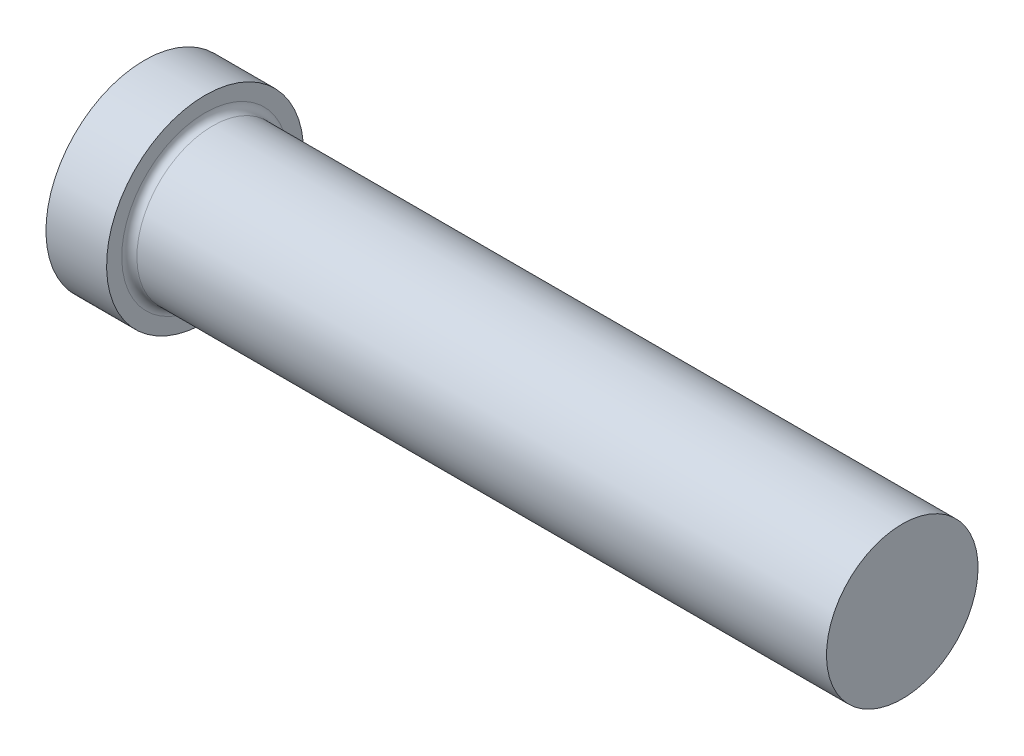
ISO-10303-21;
HEADER;
FILE_DESCRIPTION(('STEP AP214'),'2;1');
FILE_NAME('part.step','',(''),(''),'','','');
FILE_SCHEMA(('AUTOMOTIVE_DESIGN { 1 0 10303 214 1 1 1 1 }'));
ENDSEC;
DATA;
#1=APPLICATION_CONTEXT('core data for automotive mechanical design processes');
#2=APPLICATION_PROTOCOL_DEFINITION('international standard','automotive_design',2000,#1);
#3=PRODUCT_CONTEXT('',#1,'mechanical');
#4=PRODUCT('Part','Part','',(#3));
#5=PRODUCT_RELATED_PRODUCT_CATEGORY('part','',(#4));
#6=PRODUCT_DEFINITION_FORMATION('','',#4);
#7=PRODUCT_DEFINITION_CONTEXT('part definition',#1,'design');
#8=PRODUCT_DEFINITION('design','',#6,#7);
#9=PRODUCT_DEFINITION_SHAPE('','',#8);
#10=(LENGTH_UNIT() NAMED_UNIT(*) SI_UNIT(.MILLI.,.METRE.));
#11=(NAMED_UNIT(*) PLANE_ANGLE_UNIT() SI_UNIT($,.RADIAN.));
#12=(NAMED_UNIT(*) SI_UNIT($,.STERADIAN.) SOLID_ANGLE_UNIT());
#13=UNCERTAINTY_MEASURE_WITH_UNIT(LENGTH_MEASURE(1.E-05),#10,'distance_accuracy_value','');
#14=(GEOMETRIC_REPRESENTATION_CONTEXT(3) GLOBAL_UNCERTAINTY_ASSIGNED_CONTEXT((#13)) GLOBAL_UNIT_ASSIGNED_CONTEXT((#10,
#11,#12)) REPRESENTATION_CONTEXT('',''));
#15=CARTESIAN_POINT('',(0.,0.,0.));
#16=DIRECTION('',(0.,0.,1.));
#17=DIRECTION('',(1.,0.,0.));
#18=AXIS2_PLACEMENT_3D('',#15,#16,#17);
#19=CARTESIAN_POINT('',(0.,0.,0.));
#20=DIRECTION('',(-1.,0.,0.));
#21=DIRECTION('',(0.,-1.,0.));
#22=AXIS2_PLACEMENT_3D('',#19,#20,#21);
#23=PLANE('',#22);
#24=CARTESIAN_POINT('',(0.,0.,0.));
#25=DIRECTION('',(1.,0.,0.));
#26=DIRECTION('',(0.,1.,0.));
#27=AXIS2_PLACEMENT_3D('',#24,#25,#26);
#28=CIRCLE('',#27,13.);
#29=CARTESIAN_POINT('',(0.,13.,0.));
#30=VERTEX_POINT('',#29);
#31=EDGE_CURVE('E25',#30,#30,#28,.T.);
#32=ORIENTED_EDGE('',*,*,#31,.F.);
#33=EDGE_LOOP('',(#32));
#34=FACE_BOUND('',#33,.T.);
#35=ADVANCED_FACE('F14',(#34),#23,.T.);
#36=CARTESIAN_POINT('',(100.,0.,0.));
#37=DIRECTION('',(1.,0.,0.));
#38=DIRECTION('',(0.,1.,0.));
#39=AXIS2_PLACEMENT_3D('',#36,#37,#38);
#40=CYLINDRICAL_SURFACE('',#39,13.);
#41=ORIENTED_EDGE('',*,*,#31,.T.);
#42=EDGE_LOOP('',(#41));
#43=FACE_BOUND('',#42,.T.);
#44=CARTESIAN_POINT('',(8.,0.,0.));
#45=DIRECTION('',(1.,0.,0.));
#46=DIRECTION('',(0.,1.,0.));
#47=AXIS2_PLACEMENT_3D('',#44,#45,#46);
#48=CIRCLE('',#47,13.);
#49=CARTESIAN_POINT('',(8.,13.,0.));
#50=VERTEX_POINT('',#49);
#51=EDGE_CURVE('E29',#50,#50,#48,.T.);
#52=ORIENTED_EDGE('',*,*,#51,.F.);
#53=EDGE_LOOP('',(#52));
#54=FACE_BOUND('',#53,.T.);
#55=ADVANCED_FACE('F51',(#43,#54),#40,.T.);
#56=CARTESIAN_POINT('',(8.,13.,0.));
#57=DIRECTION('',(1.,0.,0.));
#58=DIRECTION('',(0.,1.,0.));
#59=AXIS2_PLACEMENT_3D('',#56,#57,#58);
#60=PLANE('',#59);
#61=CARTESIAN_POINT('',(8.,0.,0.));
#62=DIRECTION('',(1.,0.,0.));
#63=DIRECTION('',(0.,1.,0.));
#64=AXIS2_PLACEMENT_3D('',#61,#62,#63);
#65=CIRCLE('',#64,11.);
#66=CARTESIAN_POINT('',(8.,11.,0.));
#67=VERTEX_POINT('',#66);
#68=EDGE_CURVE('E9',#67,#67,#65,.F.);
#69=ORIENTED_EDGE('',*,*,#68,.T.);
#70=EDGE_LOOP('',(#69));
#71=FACE_BOUND('',#70,.T.);
#72=ORIENTED_EDGE('',*,*,#51,.T.);
#73=EDGE_LOOP('',(#72));
#74=FACE_BOUND('',#73,.T.);
#75=ADVANCED_FACE('F42',(#71,#74),#60,.T.);
#76=CARTESIAN_POINT('',(100.,0.,0.));
#77=DIRECTION('',(1.,0.,0.));
#78=DIRECTION('',(0.,1.,0.));
#79=AXIS2_PLACEMENT_3D('',#76,#77,#78);
#80=CYLINDRICAL_SURFACE('',#79,10.);
#81=CARTESIAN_POINT('',(9.,0.,0.));
#82=DIRECTION('',(1.,0.,0.));
#83=DIRECTION('',(0.,1.,0.));
#84=AXIS2_PLACEMENT_3D('',#81,#82,#83);
#85=CIRCLE('',#84,10.);
#86=CARTESIAN_POINT('',(9.,10.,0.));
#87=VERTEX_POINT('',#86);
#88=EDGE_CURVE('E21',#87,#87,#85,.T.);
#89=ORIENTED_EDGE('',*,*,#88,.T.);
#90=EDGE_LOOP('',(#89));
#91=FACE_BOUND('',#90,.T.);
#92=CARTESIAN_POINT('',(100.,0.,0.));
#93=DIRECTION('',(1.,0.,0.));
#94=DIRECTION('',(0.,1.,0.));
#95=AXIS2_PLACEMENT_3D('',#92,#93,#94);
#96=CIRCLE('',#95,10.);
#97=CARTESIAN_POINT('',(100.,9.99999999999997,0.));
#98=VERTEX_POINT('',#97);
#99=EDGE_CURVE('E34',#98,#98,#96,.T.);
#100=ORIENTED_EDGE('',*,*,#99,.F.);
#101=EDGE_LOOP('',(#100));
#102=FACE_BOUND('',#101,.T.);
#103=ADVANCED_FACE('F40',(#91,#102),#80,.T.);
#104=CARTESIAN_POINT('',(100.,10.,0.));
#105=DIRECTION('',(1.,0.,0.));
#106=DIRECTION('',(0.,1.,0.));
#107=AXIS2_PLACEMENT_3D('',#104,#105,#106);
#108=PLANE('',#107);
#109=ORIENTED_EDGE('',*,*,#99,.T.);
#110=EDGE_LOOP('',(#109));
#111=FACE_BOUND('',#110,.T.);
#112=ADVANCED_FACE('F38',(#111),#108,.T.);
#113=CARTESIAN_POINT('',(9.,0.,0.));
#114=DIRECTION('',(1.,0.,0.));
#115=DIRECTION('',(0.,1.,0.));
#116=AXIS2_PLACEMENT_3D('',#113,#114,#115);
#117=TOROIDAL_SURFACE('',#116,11.,1.);
#118=ORIENTED_EDGE('',*,*,#68,.F.);
#119=EDGE_LOOP('',(#118));
#120=FACE_BOUND('',#119,.T.);
#121=ORIENTED_EDGE('',*,*,#88,.F.);
#122=EDGE_LOOP('',(#121));
#123=FACE_BOUND('',#122,.T.);
#124=ADVANCED_FACE('F16',(#120,#123),#117,.F.);
#125=CLOSED_SHELL('',(#35,#55,#75,#103,#112,#124));
#126=MANIFOLD_SOLID_BREP('B1',#125);
#127=ADVANCED_BREP_SHAPE_REPRESENTATION('',(#18,#126),#14);
#128=SHAPE_DEFINITION_REPRESENTATION(#9,#127);
ENDSEC;
END-ISO-10303-21;
